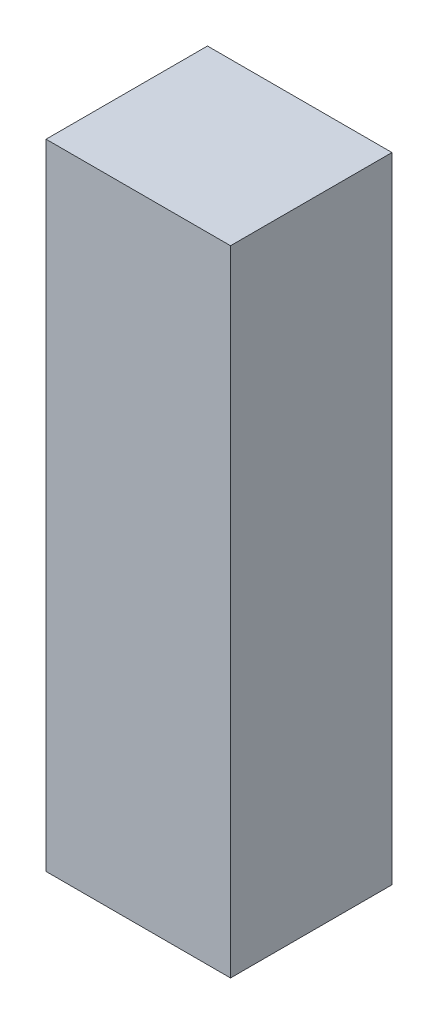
from build123d import *

# Parameters (mm, degrees)
SKETCH1_W                    = 50.8
SKETCH1_H                    = 44.45
BOSS_EXTRUDE1_DEPTH          = 174.625
F_5_16_18_TAPPED_HOLE1_D     = 6.5278
F_5_16_18_TAPPED_HOLE1_DEPTH = 20.1168
F_5_16_18_TAPPED_HOLE1_TIP   = 1.961148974
F_1_4_28_TAPPED_HOLE1_D      = 5.4102
F_1_4_28_TAPPED_HOLE1_DEPTH  = 15.4178
F_1_4_28_TAPPED_HOLE1_TIP    = 1.625388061


with BuildPart() as part:
    # Sketch1 → Boss-Extrude1 (new body)
    with BuildSketch(Plane(origin=(0, 0, 0), x_dir=(1, 0, 0), z_dir=(0, 1, 0))):
        Rectangle(SKETCH1_W, SKETCH1_H)
    extrude(amount=BOSS_EXTRUDE1_DEPTH)

    # 5_16-18 Tapped Hole1
    with Locations(Plane.XZ):
        with Locations((0, 4.445)):
            Hole(F_5_16_18_TAPPED_HOLE1_D / 2, depth=F_5_16_18_TAPPED_HOLE1_DEPTH)
            with Locations((0, 0, -(F_5_16_18_TAPPED_HOLE1_DEPTH + F_5_16_18_TAPPED_HOLE1_TIP / 2))):  # 118° drill point
                Cone(0, F_5_16_18_TAPPED_HOLE1_D / 2, F_5_16_18_TAPPED_HOLE1_TIP, mode=Mode.SUBTRACT)

    # 1_4-28 Tapped Hole1
    with Locations(Plane(origin=(0, 0, -22.225), x_dir=(-1, 0, 0), z_dir=(0, 0, -1))):
        with Locations((-19.05, 165.1), (19.05, 165.1)):
            Hole(F_1_4_28_TAPPED_HOLE1_D / 2, depth=F_1_4_28_TAPPED_HOLE1_DEPTH)
            with Locations((0, 0, -(F_1_4_28_TAPPED_HOLE1_DEPTH + F_1_4_28_TAPPED_HOLE1_TIP / 2))):  # 118° drill point
                Cone(0, F_1_4_28_TAPPED_HOLE1_D / 2, F_1_4_28_TAPPED_HOLE1_TIP, mode=Mode.SUBTRACT)


solid = part.part
